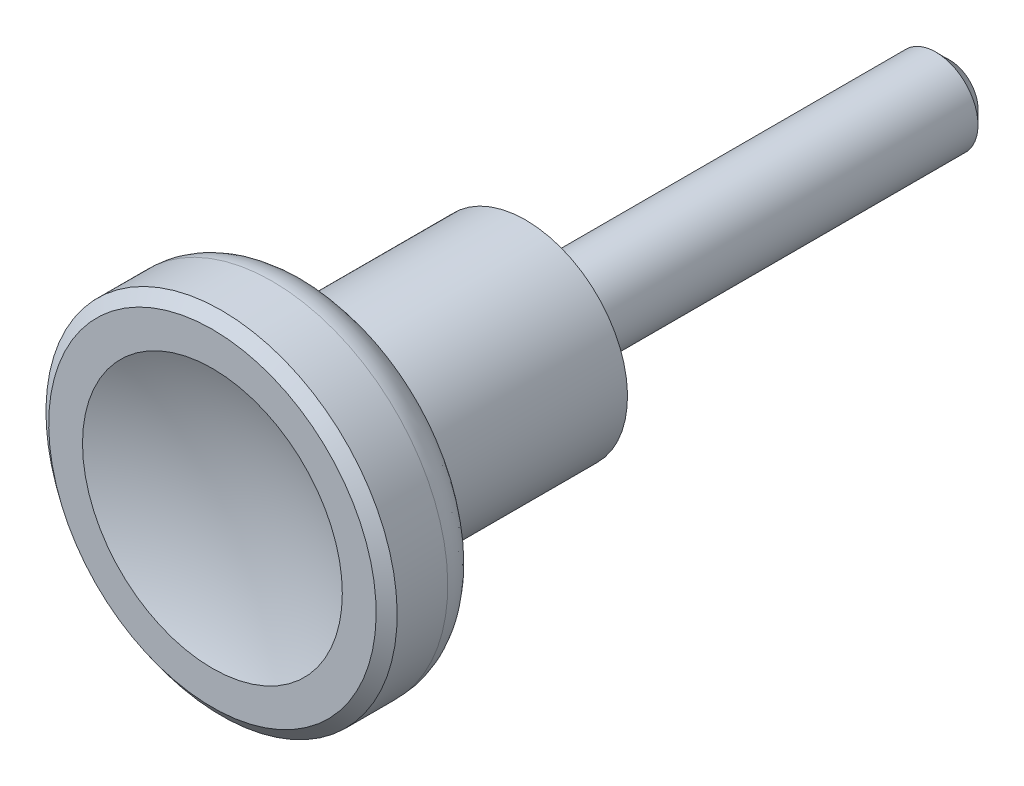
ISO-10303-21;
HEADER;
FILE_DESCRIPTION(('STEP AP214'),'2;1');
FILE_NAME('part.step','',(''),(''),'','','');
FILE_SCHEMA(('AUTOMOTIVE_DESIGN { 1 0 10303 214 1 1 1 1 }'));
ENDSEC;
DATA;
#1=APPLICATION_CONTEXT('core data for automotive mechanical design processes');
#2=APPLICATION_PROTOCOL_DEFINITION('international standard','automotive_design',2000,#1);
#3=PRODUCT_CONTEXT('',#1,'mechanical');
#4=PRODUCT('Part','Part','',(#3));
#5=PRODUCT_RELATED_PRODUCT_CATEGORY('part','',(#4));
#6=PRODUCT_DEFINITION_FORMATION('','',#4);
#7=PRODUCT_DEFINITION_CONTEXT('part definition',#1,'design');
#8=PRODUCT_DEFINITION('design','',#6,#7);
#9=PRODUCT_DEFINITION_SHAPE('','',#8);
#10=(LENGTH_UNIT() NAMED_UNIT(*) SI_UNIT(.MILLI.,.METRE.));
#11=(NAMED_UNIT(*) PLANE_ANGLE_UNIT() SI_UNIT($,.RADIAN.));
#12=(NAMED_UNIT(*) SI_UNIT($,.STERADIAN.) SOLID_ANGLE_UNIT());
#13=UNCERTAINTY_MEASURE_WITH_UNIT(LENGTH_MEASURE(1.E-05),#10,'distance_accuracy_value','');
#14=(GEOMETRIC_REPRESENTATION_CONTEXT(3) GLOBAL_UNCERTAINTY_ASSIGNED_CONTEXT((#13)) GLOBAL_UNIT_ASSIGNED_CONTEXT((#10,
#11,#12)) REPRESENTATION_CONTEXT('',''));
#15=CARTESIAN_POINT('',(0.,0.,0.));
#16=DIRECTION('',(0.,0.,1.));
#17=DIRECTION('',(1.,0.,0.));
#18=AXIS2_PLACEMENT_3D('',#15,#16,#17);
#19=CARTESIAN_POINT('',(0.,0.,43.6847281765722));
#20=DIRECTION('',(0.,-1.,0.));
#21=DIRECTION('',(1.,0.,0.));
#22=AXIS2_PLACEMENT_3D('',#19,#20,#21);
#23=SPHERICAL_SURFACE('',#22,23.1163945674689);
#24=CARTESIAN_POINT('',(0.,0.,43.6847281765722));
#25=DIRECTION('',(0.,0.,-1.));
#26=DIRECTION('',(0.,1.,0.));
#27=AXIS2_PLACEMENT_3D('',#24,#25,#26);
#28=SPHERICAL_SURFACE('',#27,23.1163945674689);
#29=CARTESIAN_POINT('',(0.,0.,22.4988392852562));
#30=DIRECTION('',(0.,0.,-1.));
#31=DIRECTION('',(0.,1.,0.));
#32=AXIS2_PLACEMENT_3D('',#29,#30,#31);
#33=CIRCLE('',#32,9.24801652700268);
#34=CARTESIAN_POINT('',(0.,9.24801652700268,22.4988392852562));
#35=VERTEX_POINT('',#34);
#36=EDGE_CURVE('E56',#35,#35,#33,.T.);
#37=ORIENTED_EDGE('',*,*,#36,.F.);
#38=EDGE_LOOP('',(#37));
#39=FACE_BOUND('',#38,.T.);
#40=ADVANCED_FACE('F12',(#39),#28,.F.);
#41=CARTESIAN_POINT('',(3.,0.,-30.));
#42=DIRECTION('',(0.,0.,1.));
#43=DIRECTION('',(0.,-1.,0.));
#44=AXIS2_PLACEMENT_3D('',#41,#42,#43);
#45=PLANE('',#44);
#46=CARTESIAN_POINT('',(0.,0.,-30.));
#47=DIRECTION('',(0.,0.,1.));
#48=DIRECTION('',(1.,0.,0.));
#49=AXIS2_PLACEMENT_3D('',#46,#47,#48);
#50=CIRCLE('',#49,2.);
#51=CARTESIAN_POINT('',(2.,0.,-30.));
#52=VERTEX_POINT('',#51);
#53=EDGE_CURVE('E19',#52,#52,#50,.F.);
#54=ORIENTED_EDGE('',*,*,#53,.T.);
#55=EDGE_LOOP('',(#54));
#56=FACE_BOUND('',#55,.T.);
#57=ADVANCED_FACE('F63',(#56),#45,.F.);
#58=CARTESIAN_POINT('',(0.,0.,-2.38339822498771));
#59=DIRECTION('',(0.,0.,-1.));
#60=DIRECTION('',(0.,1.,0.));
#61=AXIS2_PLACEMENT_3D('',#58,#59,#60);
#62=CYLINDRICAL_SURFACE('',#61,3.);
#63=CARTESIAN_POINT('',(0.,0.,-29.));
#64=DIRECTION('',(0.,0.,1.));
#65=DIRECTION('',(1.,0.,0.));
#66=AXIS2_PLACEMENT_3D('',#63,#64,#65);
#67=CIRCLE('',#66,3.);
#68=CARTESIAN_POINT('',(3.,0.,-29.));
#69=VERTEX_POINT('',#68);
#70=EDGE_CURVE('E8',#69,#69,#67,.T.);
#71=ORIENTED_EDGE('',*,*,#70,.T.);
#72=EDGE_LOOP('',(#71));
#73=FACE_BOUND('',#72,.T.);
#74=CARTESIAN_POINT('',(0.,0.,0.));
#75=DIRECTION('',(0.,0.,-1.));
#76=DIRECTION('',(0.,1.,0.));
#77=AXIS2_PLACEMENT_3D('',#74,#75,#76);
#78=CIRCLE('',#77,3.);
#79=CARTESIAN_POINT('',(0.,3.,0.));
#80=VERTEX_POINT('',#79);
#81=EDGE_CURVE('E23',#80,#80,#78,.T.);
#82=ORIENTED_EDGE('',*,*,#81,.T.);
#83=EDGE_LOOP('',(#82));
#84=FACE_BOUND('',#83,.T.);
#85=ADVANCED_FACE('F69',(#73,#84),#62,.T.);
#86=CARTESIAN_POINT('',(3.,0.,0.));
#87=DIRECTION('',(0.,0.,-1.));
#88=DIRECTION('',(0.,1.,0.));
#89=AXIS2_PLACEMENT_3D('',#86,#87,#88);
#90=PLANE('',#89);
#91=CARTESIAN_POINT('',(0.,0.,0.));
#92=DIRECTION('',(0.,0.,-1.));
#93=DIRECTION('',(0.,1.,0.));
#94=AXIS2_PLACEMENT_3D('',#91,#92,#93);
#95=CIRCLE('',#94,4.5);
#96=CARTESIAN_POINT('',(0.,4.5,0.));
#97=VERTEX_POINT('',#96);
#98=EDGE_CURVE('E27',#97,#97,#95,.T.);
#99=ORIENTED_EDGE('',*,*,#98,.T.);
#100=EDGE_LOOP('',(#99));
#101=FACE_BOUND('',#100,.T.);
#102=ORIENTED_EDGE('',*,*,#81,.F.);
#103=EDGE_LOOP('',(#102));
#104=FACE_BOUND('',#103,.T.);
#105=ADVANCED_FACE('F74',(#101,#104),#90,.T.);
#106=CARTESIAN_POINT('',(0.,0.,-2.38339822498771));
#107=DIRECTION('',(0.,0.,-1.));
#108=DIRECTION('',(0.,1.,0.));
#109=AXIS2_PLACEMENT_3D('',#106,#107,#108);
#110=CYLINDRICAL_SURFACE('',#109,4.5);
#111=ORIENTED_EDGE('',*,*,#98,.F.);
#112=EDGE_LOOP('',(#111));
#113=FACE_BOUND('',#112,.T.);
#114=CARTESIAN_POINT('',(0.,0.,0.200000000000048));
#115=DIRECTION('',(0.,0.,-1.));
#116=DIRECTION('',(0.,1.,0.));
#117=AXIS2_PLACEMENT_3D('',#114,#115,#116);
#118=CIRCLE('',#117,4.5);
#119=CARTESIAN_POINT('',(0.,4.5,0.200000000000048));
#120=VERTEX_POINT('',#119);
#121=EDGE_CURVE('E32',#120,#120,#118,.T.);
#122=ORIENTED_EDGE('',*,*,#121,.T.);
#123=EDGE_LOOP('',(#122));
#124=FACE_BOUND('',#123,.T.);
#125=ADVANCED_FACE('F77',(#113,#124),#110,.T.);
#126=CARTESIAN_POINT('',(4.5000000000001,0.,0.200000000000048));
#127=DIRECTION('',(0.,0.,-1.));
#128=DIRECTION('',(0.,1.,0.));
#129=AXIS2_PLACEMENT_3D('',#126,#127,#128);
#130=PLANE('',#129);
#131=CARTESIAN_POINT('',(0.,0.,0.200000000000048));
#132=DIRECTION('',(0.,0.,-1.));
#133=DIRECTION('',(0.,1.,0.));
#134=AXIS2_PLACEMENT_3D('',#131,#132,#133);
#135=CIRCLE('',#134,7.25);
#136=CARTESIAN_POINT('',(0.,7.25,0.200000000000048));
#137=VERTEX_POINT('',#136);
#138=EDGE_CURVE('E35',#137,#137,#135,.T.);
#139=ORIENTED_EDGE('',*,*,#138,.T.);
#140=EDGE_LOOP('',(#139));
#141=FACE_BOUND('',#140,.T.);
#142=ORIENTED_EDGE('',*,*,#121,.F.);
#143=EDGE_LOOP('',(#142));
#144=FACE_BOUND('',#143,.T.);
#145=ADVANCED_FACE('F81',(#141,#144),#130,.T.);
#146=CARTESIAN_POINT('',(0.,0.,-2.38339822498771));
#147=DIRECTION('',(0.,0.,-1.));
#148=DIRECTION('',(0.,1.,0.));
#149=AXIS2_PLACEMENT_3D('',#146,#147,#148);
#150=CYLINDRICAL_SURFACE('',#149,7.25);
#151=CARTESIAN_POINT('',(0.,0.,14.));
#152=DIRECTION('',(0.,0.,-1.));
#153=DIRECTION('',(0.,1.,0.));
#154=AXIS2_PLACEMENT_3D('',#151,#152,#153);
#155=CIRCLE('',#154,7.25);
#156=CARTESIAN_POINT('',(0.,7.25,14.));
#157=VERTEX_POINT('',#156);
#158=EDGE_CURVE('E38',#157,#157,#155,.T.);
#159=ORIENTED_EDGE('',*,*,#158,.T.);
#160=EDGE_LOOP('',(#159));
#161=FACE_BOUND('',#160,.T.);
#162=ORIENTED_EDGE('',*,*,#138,.F.);
#163=EDGE_LOOP('',(#162));
#164=FACE_BOUND('',#163,.T.);
#165=ADVANCED_FACE('F85',(#161,#164),#150,.T.);
#166=CARTESIAN_POINT('',(0.,0.,14.));
#167=DIRECTION('',(0.,0.,-1.));
#168=DIRECTION('',(0.,1.,0.));
#169=AXIS2_PLACEMENT_3D('',#166,#167,#168);
#170=TOROIDAL_SURFACE('',#169,7.75,0.5);
#171=ORIENTED_EDGE('',*,*,#158,.F.);
#172=EDGE_LOOP('',(#171));
#173=FACE_BOUND('',#172,.T.);
#174=CARTESIAN_POINT('',(0.,0.,14.4670163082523));
#175=DIRECTION('',(0.,0.,-1.));
#176=DIRECTION('',(0.,1.,0.));
#177=AXIS2_PLACEMENT_3D('',#174,#175,#176);
#178=CIRCLE('',#177,7.57140613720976);
#179=CARTESIAN_POINT('',(0.,7.57140613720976,14.4670163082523));
#180=VERTEX_POINT('',#179);
#181=EDGE_CURVE('E41',#180,#180,#178,.T.);
#182=ORIENTED_EDGE('',*,*,#181,.T.);
#183=EDGE_LOOP('',(#182));
#184=FACE_BOUND('',#183,.T.);
#185=ADVANCED_FACE('F89',(#173,#184),#170,.F.);
#186=CARTESIAN_POINT('',(0.,0.,14.4670163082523));
#187=DIRECTION('',(0.,0.,1.));
#188=DIRECTION('',(0.,-1.,0.));
#189=AXIS2_PLACEMENT_3D('',#186,#187,#188);
#190=CONICAL_SURFACE('',#189,7.57140613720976,1.20554106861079);
#191=CARTESIAN_POINT('',(0.,0.,15.675774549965));
#192=DIRECTION('',(0.,0.,-1.));
#193=DIRECTION('',(0.,1.,0.));
#194=AXIS2_PLACEMENT_3D('',#191,#192,#193);
#195=CIRCLE('',#194,10.7322639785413);
#196=CARTESIAN_POINT('',(0.,10.7322639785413,15.675774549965));
#197=VERTEX_POINT('',#196);
#198=EDGE_CURVE('E44',#197,#197,#195,.T.);
#199=ORIENTED_EDGE('',*,*,#198,.T.);
#200=EDGE_LOOP('',(#199));
#201=FACE_BOUND('',#200,.T.);
#202=ORIENTED_EDGE('',*,*,#181,.F.);
#203=EDGE_LOOP('',(#202));
#204=FACE_BOUND('',#203,.T.);
#205=ADVANCED_FACE('F93',(#201,#204),#190,.T.);
#206=CARTESIAN_POINT('',(0.,0.,18.2443675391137));
#207=DIRECTION('',(0.,0.,-1.));
#208=DIRECTION('',(0.,1.,0.));
#209=AXIS2_PLACEMENT_3D('',#206,#207,#208);
#210=TOROIDAL_SURFACE('',#209,9.74999647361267,2.75000352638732);
#211=CARTESIAN_POINT('',(0.,0.,18.2443675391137));
#212=DIRECTION('',(0.,0.,-1.));
#213=DIRECTION('',(0.,1.,0.));
#214=AXIS2_PLACEMENT_3D('',#211,#212,#213);
#215=CIRCLE('',#214,12.5);
#216=CARTESIAN_POINT('',(0.,12.5,18.2443675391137));
#217=VERTEX_POINT('',#216);
#218=EDGE_CURVE('E47',#217,#217,#215,.T.);
#219=ORIENTED_EDGE('',*,*,#218,.T.);
#220=EDGE_LOOP('',(#219));
#221=FACE_BOUND('',#220,.T.);
#222=ORIENTED_EDGE('',*,*,#198,.F.);
#223=EDGE_LOOP('',(#222));
#224=FACE_BOUND('',#223,.T.);
#225=ADVANCED_FACE('F97',(#221,#224),#210,.T.);
#226=CARTESIAN_POINT('',(0.,0.,-2.38339822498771));
#227=DIRECTION('',(0.,0.,-1.));
#228=DIRECTION('',(0.,1.,0.));
#229=AXIS2_PLACEMENT_3D('',#226,#227,#228);
#230=CYLINDRICAL_SURFACE('',#229,12.5);
#231=ORIENTED_EDGE('',*,*,#218,.F.);
#232=EDGE_LOOP('',(#231));
#233=FACE_BOUND('',#232,.T.);
#234=CARTESIAN_POINT('',(0.,0.,21.8478667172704));
#235=DIRECTION('',(0.,0.,-1.));
#236=DIRECTION('',(0.,1.,0.));
#237=AXIS2_PLACEMENT_3D('',#234,#235,#236);
#238=CIRCLE('',#237,12.5);
#239=CARTESIAN_POINT('',(0.,12.5,21.8478667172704));
#240=VERTEX_POINT('',#239);
#241=EDGE_CURVE('E50',#240,#240,#238,.T.);
#242=ORIENTED_EDGE('',*,*,#241,.T.);
#243=EDGE_LOOP('',(#242));
#244=FACE_BOUND('',#243,.T.);
#245=ADVANCED_FACE('F101',(#233,#244),#230,.T.);
#246=CARTESIAN_POINT('',(0.,0.,22.4983919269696));
#247=DIRECTION('',(0.,0.,-1.));
#248=DIRECTION('',(0.,1.,0.));
#249=AXIS2_PLACEMENT_3D('',#246,#247,#248);
#250=CONICAL_SURFACE('',#249,11.6552976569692,0.914540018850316);
#251=ORIENTED_EDGE('',*,*,#241,.F.);
#252=EDGE_LOOP('',(#251));
#253=FACE_BOUND('',#252,.T.);
#254=CARTESIAN_POINT('',(0.,0.,22.4983919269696));
#255=DIRECTION('',(0.,0.,-1.));
#256=DIRECTION('',(0.,1.,0.));
#257=AXIS2_PLACEMENT_3D('',#254,#255,#256);
#258=CIRCLE('',#257,11.6552976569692);
#259=CARTESIAN_POINT('',(0.,11.6552976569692,22.4983919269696));
#260=VERTEX_POINT('',#259);
#261=EDGE_CURVE('E53',#260,#260,#258,.T.);
#262=ORIENTED_EDGE('',*,*,#261,.T.);
#263=EDGE_LOOP('',(#262));
#264=FACE_BOUND('',#263,.T.);
#265=ADVANCED_FACE('F105',(#253,#264),#250,.T.);
#266=CARTESIAN_POINT('',(0.,0.,22.4988392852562));
#267=DIRECTION('',(0.,0.,-1.));
#268=DIRECTION('',(0.,1.,0.));
#269=AXIS2_PLACEMENT_3D('',#266,#267,#268);
#270=CONICAL_SURFACE('',#269,9.24801652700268,1.57061049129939);
#271=ORIENTED_EDGE('',*,*,#261,.F.);
#272=EDGE_LOOP('',(#271));
#273=FACE_BOUND('',#272,.T.);
#274=ORIENTED_EDGE('',*,*,#36,.T.);
#275=EDGE_LOOP('',(#274));
#276=FACE_BOUND('',#275,.T.);
#277=ADVANCED_FACE('F60',(#273,#276),#270,.T.);
#278=CARTESIAN_POINT('',(0.,0.,-30.));
#279=DIRECTION('',(0.,0.,1.));
#280=DIRECTION('',(1.,0.,0.));
#281=AXIS2_PLACEMENT_3D('',#278,#279,#280);
#282=CONICAL_SURFACE('',#281,2.,0.785398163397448);
#283=ORIENTED_EDGE('',*,*,#70,.F.);
#284=EDGE_LOOP('',(#283));
#285=FACE_BOUND('',#284,.T.);
#286=ORIENTED_EDGE('',*,*,#53,.F.);
#287=EDGE_LOOP('',(#286));
#288=FACE_BOUND('',#287,.T.);
#289=ADVANCED_FACE('F14',(#285,#288),#282,.T.);
#290=CLOSED_SHELL('',(#40,#57,#85,#105,#125,#145,#165,#185,#205,#225,#245,#265,#277,#289));
#291=MANIFOLD_SOLID_BREP('B1',#290);
#292=ADVANCED_BREP_SHAPE_REPRESENTATION('',(#18,#291),#14);
#293=SHAPE_DEFINITION_REPRESENTATION(#9,#292);
ENDSEC;
END-ISO-10303-21;
